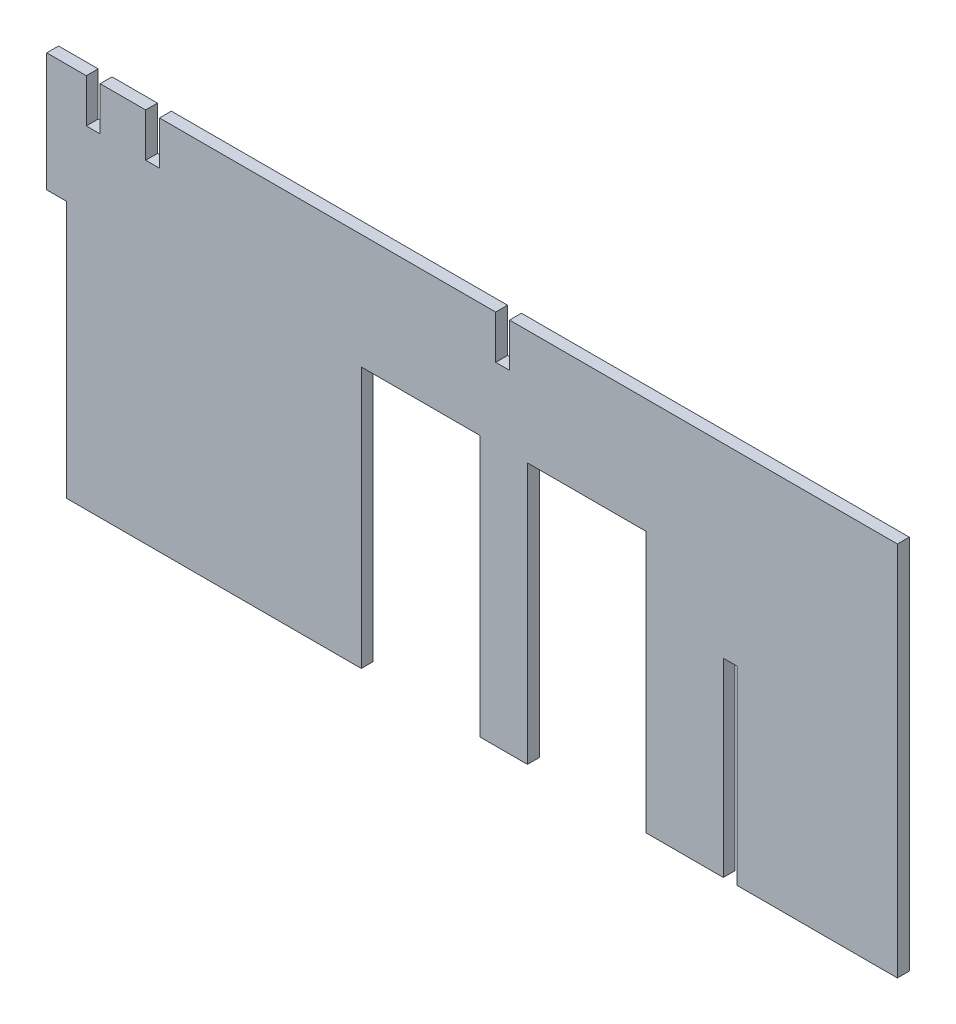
ISO-10303-21;
HEADER;
FILE_DESCRIPTION(('STEP AP214'),'2;1');
FILE_NAME('part.step','',(''),(''),'','','');
FILE_SCHEMA(('AUTOMOTIVE_DESIGN { 1 0 10303 214 1 1 1 1 }'));
ENDSEC;
DATA;
#1=APPLICATION_CONTEXT('core data for automotive mechanical design processes');
#2=APPLICATION_PROTOCOL_DEFINITION('international standard','automotive_design',2000,#1);
#3=PRODUCT_CONTEXT('',#1,'mechanical');
#4=PRODUCT('Part','Part','',(#3));
#5=PRODUCT_RELATED_PRODUCT_CATEGORY('part','',(#4));
#6=PRODUCT_DEFINITION_FORMATION('','',#4);
#7=PRODUCT_DEFINITION_CONTEXT('part definition',#1,'design');
#8=PRODUCT_DEFINITION('design','',#6,#7);
#9=PRODUCT_DEFINITION_SHAPE('','',#8);
#10=(LENGTH_UNIT() NAMED_UNIT(*) SI_UNIT(.MILLI.,.METRE.));
#11=(NAMED_UNIT(*) PLANE_ANGLE_UNIT() SI_UNIT($,.RADIAN.));
#12=(NAMED_UNIT(*) SI_UNIT($,.STERADIAN.) SOLID_ANGLE_UNIT());
#13=UNCERTAINTY_MEASURE_WITH_UNIT(LENGTH_MEASURE(1.E-05),#10,'distance_accuracy_value','');
#14=(GEOMETRIC_REPRESENTATION_CONTEXT(3) GLOBAL_UNCERTAINTY_ASSIGNED_CONTEXT((#13)) GLOBAL_UNIT_ASSIGNED_CONTEXT((#10,
#11,#12)) REPRESENTATION_CONTEXT('',''));
#15=CARTESIAN_POINT('',(0.,0.,0.));
#16=DIRECTION('',(0.,0.,1.));
#17=DIRECTION('',(1.,0.,0.));
#18=AXIS2_PLACEMENT_3D('',#15,#16,#17);
#19=CARTESIAN_POINT('',(0.,0.,3.));
#20=DIRECTION('',(0.,1.,0.));
#21=DIRECTION('',(0.,0.,1.));
#22=AXIS2_PLACEMENT_3D('',#19,#20,#21);
#23=PLANE('',#22);
#24=DIRECTION('',(1.,0.,0.));
#25=VECTOR('',#24,1.);
#26=CARTESIAN_POINT('',(0.,0.,0.));
#27=LINE('',#26,#25);
#28=CARTESIAN_POINT('',(151.5,0.,0.));
#29=VERTEX_POINT('',#28);
#30=CARTESIAN_POINT('',(171.,0.,0.));
#31=VERTEX_POINT('',#30);
#32=EDGE_CURVE('E244',#29,#31,#27,.T.);
#33=ORIENTED_EDGE('',*,*,#32,.T.);
#34=DIRECTION('',(0.,0.,1.));
#35=VECTOR('',#34,1.);
#36=CARTESIAN_POINT('',(171.,0.,0.));
#37=LINE('',#36,#35);
#38=CARTESIAN_POINT('',(171.,0.,3.));
#39=VERTEX_POINT('',#38);
#40=EDGE_CURVE('E228',#31,#39,#37,.T.);
#41=ORIENTED_EDGE('',*,*,#40,.T.);
#42=DIRECTION('',(1.,0.,0.));
#43=VECTOR('',#42,1.);
#44=CARTESIAN_POINT('',(0.,0.,3.));
#45=LINE('',#44,#43);
#46=CARTESIAN_POINT('',(151.5,0.,3.));
#47=VERTEX_POINT('',#46);
#48=EDGE_CURVE('E501',#47,#39,#45,.T.);
#49=ORIENTED_EDGE('',*,*,#48,.F.);
#50=DIRECTION('',(0.,0.,1.));
#51=VECTOR('',#50,1.);
#52=CARTESIAN_POINT('',(151.5,0.,0.));
#53=LINE('',#52,#51);
#54=EDGE_CURVE('E250',#29,#47,#53,.T.);
#55=ORIENTED_EDGE('',*,*,#54,.F.);
#56=EDGE_LOOP('',(#33,#41,#49,#55));
#57=FACE_BOUND('',#56,.T.);
#58=ADVANCED_FACE('F31',(#57),#23,.F.);
#59=CARTESIAN_POINT('',(0.,95.,3.));
#60=DIRECTION('',(0.,-1.,0.));
#61=DIRECTION('',(0.,0.,-1.));
#62=AXIS2_PLACEMENT_3D('',#59,#60,#61);
#63=PLANE('',#62);
#64=DIRECTION('',(-1.,0.,0.));
#65=VECTOR('',#64,1.);
#66=CARTESIAN_POINT('',(0.,95.,3.));
#67=LINE('',#66,#65);
#68=CARTESIAN_POINT('',(113.470074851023,95.,3.));
#69=VERTEX_POINT('',#68);
#70=CARTESIAN_POINT('',(28.5,95.,3.));
#71=VERTEX_POINT('',#70);
#72=EDGE_CURVE('E441',#69,#71,#67,.T.);
#73=ORIENTED_EDGE('',*,*,#72,.F.);
#74=DIRECTION('',(0.,0.,1.));
#75=VECTOR('',#74,1.);
#76=CARTESIAN_POINT('',(113.470074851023,95.,0.));
#77=LINE('',#76,#75);
#78=CARTESIAN_POINT('',(113.470074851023,95.,0.));
#79=VERTEX_POINT('',#78);
#80=EDGE_CURVE('E305',#79,#69,#77,.T.);
#81=ORIENTED_EDGE('',*,*,#80,.F.);
#82=DIRECTION('',(-1.,0.,0.));
#83=VECTOR('',#82,1.);
#84=CARTESIAN_POINT('',(0.,95.,0.));
#85=LINE('',#84,#83);
#86=CARTESIAN_POINT('',(28.5,95.,0.));
#87=VERTEX_POINT('',#86);
#88=EDGE_CURVE('E268',#79,#87,#85,.T.);
#89=ORIENTED_EDGE('',*,*,#88,.T.);
#90=DIRECTION('',(0.,0.,1.));
#91=VECTOR('',#90,1.);
#92=CARTESIAN_POINT('',(28.5,95.,0.));
#93=LINE('',#92,#91);
#94=EDGE_CURVE('E332',#87,#71,#93,.T.);
#95=ORIENTED_EDGE('',*,*,#94,.T.);
#96=EDGE_LOOP('',(#73,#81,#89,#95));
#97=FACE_BOUND('',#96,.T.);
#98=ADVANCED_FACE('F520',(#97),#63,.F.);
#99=CARTESIAN_POINT('',(25.,95.,3.));
#100=VERTEX_POINT('',#99);
#101=CARTESIAN_POINT('',(13.5,95.,3.));
#102=VERTEX_POINT('',#101);
#103=EDGE_CURVE('E444',#100,#102,#67,.T.);
#104=ORIENTED_EDGE('',*,*,#103,.F.);
#105=DIRECTION('',(0.,0.,1.));
#106=VECTOR('',#105,1.);
#107=CARTESIAN_POINT('',(25.,95.,0.));
#108=LINE('',#107,#106);
#109=CARTESIAN_POINT('',(25.,95.,0.));
#110=VERTEX_POINT('',#109);
#111=EDGE_CURVE('E329',#110,#100,#108,.T.);
#112=ORIENTED_EDGE('',*,*,#111,.F.);
#113=CARTESIAN_POINT('',(13.5,95.,0.));
#114=VERTEX_POINT('',#113);
#115=EDGE_CURVE('E462',#110,#114,#85,.T.);
#116=ORIENTED_EDGE('',*,*,#115,.T.);
#117=DIRECTION('',(0.,0.,1.));
#118=VECTOR('',#117,1.);
#119=CARTESIAN_POINT('',(13.5,95.,0.));
#120=LINE('',#119,#118);
#121=EDGE_CURVE('E359',#114,#102,#120,.T.);
#122=ORIENTED_EDGE('',*,*,#121,.T.);
#123=EDGE_LOOP('',(#104,#112,#116,#122));
#124=FACE_BOUND('',#123,.T.);
#125=ADVANCED_FACE('F460',(#124),#63,.F.);
#126=CARTESIAN_POINT('',(10.,95.,3.));
#127=VERTEX_POINT('',#126);
#128=CARTESIAN_POINT('',(0.,95.,3.));
#129=VERTEX_POINT('',#128);
#130=EDGE_CURVE('E440',#127,#129,#67,.T.);
#131=ORIENTED_EDGE('',*,*,#130,.F.);
#132=DIRECTION('',(0.,0.,1.));
#133=VECTOR('',#132,1.);
#134=CARTESIAN_POINT('',(10.,95.,0.));
#135=LINE('',#134,#133);
#136=CARTESIAN_POINT('',(10.,95.,0.));
#137=VERTEX_POINT('',#136);
#138=EDGE_CURVE('E356',#137,#127,#135,.T.);
#139=ORIENTED_EDGE('',*,*,#138,.F.);
#140=CARTESIAN_POINT('',(0.,95.,0.));
#141=VERTEX_POINT('',#140);
#142=EDGE_CURVE('E263',#137,#141,#85,.T.);
#143=ORIENTED_EDGE('',*,*,#142,.T.);
#144=DIRECTION('',(0.,0.,-1.));
#145=VECTOR('',#144,1.);
#146=CARTESIAN_POINT('',(0.,95.,3.));
#147=LINE('',#146,#145);
#148=EDGE_CURVE('E269',#129,#141,#147,.T.);
#149=ORIENTED_EDGE('',*,*,#148,.F.);
#150=EDGE_LOOP('',(#131,#139,#143,#149));
#151=FACE_BOUND('',#150,.T.);
#152=ADVANCED_FACE('F466',(#151),#63,.F.);
#153=CARTESIAN_POINT('',(109.5,0.,0.));
#154=VERTEX_POINT('',#153);
#155=CARTESIAN_POINT('',(121.5,0.,0.));
#156=VERTEX_POINT('',#155);
#157=EDGE_CURVE('E251',#154,#156,#27,.T.);
#158=ORIENTED_EDGE('',*,*,#157,.T.);
#159=DIRECTION('',(0.,0.,1.));
#160=VECTOR('',#159,1.);
#161=CARTESIAN_POINT('',(121.5,0.,0.));
#162=LINE('',#161,#160);
#163=CARTESIAN_POINT('',(121.5,0.,3.));
#164=VERTEX_POINT('',#163);
#165=EDGE_CURVE('E374',#156,#164,#162,.T.);
#166=ORIENTED_EDGE('',*,*,#165,.T.);
#167=CARTESIAN_POINT('',(109.5,0.,3.));
#168=VERTEX_POINT('',#167);
#169=EDGE_CURVE('E439',#168,#164,#45,.T.);
#170=ORIENTED_EDGE('',*,*,#169,.F.);
#171=DIRECTION('',(0.,0.,1.));
#172=VECTOR('',#171,1.);
#173=CARTESIAN_POINT('',(109.5,0.,0.));
#174=LINE('',#173,#172);
#175=EDGE_CURVE('E411',#154,#168,#174,.T.);
#176=ORIENTED_EDGE('',*,*,#175,.F.);
#177=EDGE_LOOP('',(#158,#166,#170,#176));
#178=FACE_BOUND('',#177,.T.);
#179=ADVANCED_FACE('F500',(#178),#23,.F.);
#180=CARTESIAN_POINT('',(5.00000000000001,0.,0.));
#181=VERTEX_POINT('',#180);
#182=CARTESIAN_POINT('',(79.5,0.,0.));
#183=VERTEX_POINT('',#182);
#184=EDGE_CURVE('E255',#181,#183,#27,.T.);
#185=ORIENTED_EDGE('',*,*,#184,.T.);
#186=DIRECTION('',(0.,0.,1.));
#187=VECTOR('',#186,1.);
#188=CARTESIAN_POINT('',(79.5,0.,0.));
#189=LINE('',#188,#187);
#190=CARTESIAN_POINT('',(79.5,0.,3.));
#191=VERTEX_POINT('',#190);
#192=EDGE_CURVE('E399',#183,#191,#189,.T.);
#193=ORIENTED_EDGE('',*,*,#192,.T.);
#194=CARTESIAN_POINT('',(5.00000000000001,0.,3.));
#195=VERTEX_POINT('',#194);
#196=EDGE_CURVE('E435',#195,#191,#45,.T.);
#197=ORIENTED_EDGE('',*,*,#196,.F.);
#198=DIRECTION('',(0.,0.,1.));
#199=VECTOR('',#198,1.);
#200=CARTESIAN_POINT('',(5.00000000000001,0.,0.));
#201=LINE('',#200,#199);
#202=EDGE_CURVE('E422',#181,#195,#201,.T.);
#203=ORIENTED_EDGE('',*,*,#202,.F.);
#204=EDGE_LOOP('',(#185,#193,#197,#203));
#205=FACE_BOUND('',#204,.T.);
#206=ADVANCED_FACE('F483',(#205),#23,.F.);
#207=CARTESIAN_POINT('',(0.,0.,3.));
#208=DIRECTION('',(1.,0.,0.));
#209=DIRECTION('',(0.,0.,-1.));
#210=AXIS2_PLACEMENT_3D('',#207,#208,#209);
#211=PLANE('',#210);
#212=DIRECTION('',(0.,-1.,0.));
#213=VECTOR('',#212,1.);
#214=CARTESIAN_POINT('',(0.,0.,0.));
#215=LINE('',#214,#213);
#216=CARTESIAN_POINT('',(0.,65.,0.));
#217=VERTEX_POINT('',#216);
#218=EDGE_CURVE('E256',#141,#217,#215,.T.);
#219=ORIENTED_EDGE('',*,*,#218,.T.);
#220=DIRECTION('',(0.,0.,1.));
#221=VECTOR('',#220,1.);
#222=CARTESIAN_POINT('',(0.,65.,0.));
#223=LINE('',#222,#221);
#224=CARTESIAN_POINT('',(0.,65.,3.));
#225=VERTEX_POINT('',#224);
#226=EDGE_CURVE('E426',#217,#225,#223,.T.);
#227=ORIENTED_EDGE('',*,*,#226,.T.);
#228=DIRECTION('',(0.,-1.,0.));
#229=VECTOR('',#228,1.);
#230=CARTESIAN_POINT('',(0.,0.,3.));
#231=LINE('',#230,#229);
#232=EDGE_CURVE('E267',#129,#225,#231,.T.);
#233=ORIENTED_EDGE('',*,*,#232,.F.);
#234=ORIENTED_EDGE('',*,*,#148,.T.);
#235=EDGE_LOOP('',(#219,#227,#233,#234));
#236=FACE_BOUND('',#235,.T.);
#237=ADVANCED_FACE('F33',(#236),#211,.F.);
#238=CARTESIAN_POINT('',(174.5,0.,3.));
#239=VERTEX_POINT('',#238);
#240=CARTESIAN_POINT('',(215.,0.,3.));
#241=VERTEX_POINT('',#240);
#242=EDGE_CURVE('E434',#239,#241,#45,.T.);
#243=ORIENTED_EDGE('',*,*,#242,.F.);
#244=DIRECTION('',(0.,0.,1.));
#245=VECTOR('',#244,1.);
#246=CARTESIAN_POINT('',(174.5,0.,0.));
#247=LINE('',#246,#245);
#248=CARTESIAN_POINT('',(174.5,0.,0.));
#249=VERTEX_POINT('',#248);
#250=EDGE_CURVE('E238',#249,#239,#247,.T.);
#251=ORIENTED_EDGE('',*,*,#250,.F.);
#252=CARTESIAN_POINT('',(215.,0.,0.));
#253=VERTEX_POINT('',#252);
#254=EDGE_CURVE('E252',#249,#253,#27,.T.);
#255=ORIENTED_EDGE('',*,*,#254,.T.);
#256=DIRECTION('',(0.,0.,-1.));
#257=VECTOR('',#256,1.);
#258=CARTESIAN_POINT('',(215.,0.,3.));
#259=LINE('',#258,#257);
#260=EDGE_CURVE('E11',#241,#253,#259,.T.);
#261=ORIENTED_EDGE('',*,*,#260,.F.);
#262=EDGE_LOOP('',(#243,#251,#255,#261));
#263=FACE_BOUND('',#262,.T.);
#264=ADVANCED_FACE('F511',(#263),#23,.F.);
#265=CARTESIAN_POINT('',(215.,0.,3.));
#266=DIRECTION('',(-1.,0.,0.));
#267=DIRECTION('',(0.,0.,1.));
#268=AXIS2_PLACEMENT_3D('',#265,#266,#267);
#269=PLANE('',#268);
#270=DIRECTION('',(0.,1.,0.));
#271=VECTOR('',#270,1.);
#272=CARTESIAN_POINT('',(215.,0.,0.));
#273=LINE('',#272,#271);
#274=CARTESIAN_POINT('',(215.,95.,0.));
#275=VERTEX_POINT('',#274);
#276=EDGE_CURVE('E260',#253,#275,#273,.T.);
#277=ORIENTED_EDGE('',*,*,#276,.T.);
#278=DIRECTION('',(0.,0.,-1.));
#279=VECTOR('',#278,1.);
#280=CARTESIAN_POINT('',(215.,95.,3.));
#281=LINE('',#280,#279);
#282=CARTESIAN_POINT('',(215.,95.,3.));
#283=VERTEX_POINT('',#282);
#284=EDGE_CURVE('E39',#283,#275,#281,.T.);
#285=ORIENTED_EDGE('',*,*,#284,.F.);
#286=DIRECTION('',(0.,1.,0.));
#287=VECTOR('',#286,1.);
#288=CARTESIAN_POINT('',(215.,0.,3.));
#289=LINE('',#288,#287);
#290=EDGE_CURVE('E438',#241,#283,#289,.T.);
#291=ORIENTED_EDGE('',*,*,#290,.F.);
#292=ORIENTED_EDGE('',*,*,#260,.T.);
#293=EDGE_LOOP('',(#277,#285,#291,#292));
#294=FACE_BOUND('',#293,.T.);
#295=ADVANCED_FACE('F512',(#294),#269,.F.);
#296=CARTESIAN_POINT('',(116.970074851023,95.,0.));
#297=VERTEX_POINT('',#296);
#298=EDGE_CURVE('E264',#275,#297,#85,.T.);
#299=ORIENTED_EDGE('',*,*,#298,.T.);
#300=DIRECTION('',(0.,0.,1.));
#301=VECTOR('',#300,1.);
#302=CARTESIAN_POINT('',(116.970074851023,95.,0.));
#303=LINE('',#302,#301);
#304=CARTESIAN_POINT('',(116.970074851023,95.,3.));
#305=VERTEX_POINT('',#304);
#306=EDGE_CURVE('E308',#297,#305,#303,.T.);
#307=ORIENTED_EDGE('',*,*,#306,.T.);
#308=EDGE_CURVE('E271',#283,#305,#67,.T.);
#309=ORIENTED_EDGE('',*,*,#308,.F.);
#310=ORIENTED_EDGE('',*,*,#284,.T.);
#311=EDGE_LOOP('',(#299,#307,#309,#310));
#312=FACE_BOUND('',#311,.T.);
#313=ADVANCED_FACE('F277',(#312),#63,.F.);
#314=CARTESIAN_POINT('',(0.,95.,3.));
#315=DIRECTION('',(0.,0.,-1.));
#316=DIRECTION('',(-1.,0.,0.));
#317=AXIS2_PLACEMENT_3D('',#314,#315,#316);
#318=PLANE('',#317);
#319=ORIENTED_EDGE('',*,*,#48,.T.);
#320=DIRECTION('',(0.,-1.,0.));
#321=VECTOR('',#320,1.);
#322=CARTESIAN_POINT('',(171.,0.,3.));
#323=LINE('',#322,#321);
#324=CARTESIAN_POINT('',(171.,48.,3.));
#325=VERTEX_POINT('',#324);
#326=EDGE_CURVE('E233',#325,#39,#323,.T.);
#327=ORIENTED_EDGE('',*,*,#326,.F.);
#328=DIRECTION('',(-1.,0.,0.));
#329=VECTOR('',#328,1.);
#330=CARTESIAN_POINT('',(171.,48.,3.));
#331=LINE('',#330,#329);
#332=CARTESIAN_POINT('',(174.5,48.,3.));
#333=VERTEX_POINT('',#332);
#334=EDGE_CURVE('E247',#333,#325,#331,.T.);
#335=ORIENTED_EDGE('',*,*,#334,.F.);
#336=DIRECTION('',(0.,1.,0.));
#337=VECTOR('',#336,1.);
#338=CARTESIAN_POINT('',(174.5,0.,3.));
#339=LINE('',#338,#337);
#340=EDGE_CURVE('E508',#239,#333,#339,.T.);
#341=ORIENTED_EDGE('',*,*,#340,.F.);
#342=ORIENTED_EDGE('',*,*,#242,.T.);
#343=ORIENTED_EDGE('',*,*,#290,.T.);
#344=ORIENTED_EDGE('',*,*,#308,.T.);
#345=DIRECTION('',(0.,1.,0.));
#346=VECTOR('',#345,1.);
#347=CARTESIAN_POINT('',(116.970074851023,95.,3.));
#348=LINE('',#347,#346);
#349=CARTESIAN_POINT('',(116.970074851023,84.,3.));
#350=VERTEX_POINT('',#349);
#351=EDGE_CURVE('E303',#350,#305,#348,.T.);
#352=ORIENTED_EDGE('',*,*,#351,.F.);
#353=DIRECTION('',(1.,0.,0.));
#354=VECTOR('',#353,1.);
#355=CARTESIAN_POINT('',(113.470074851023,84.,3.));
#356=LINE('',#355,#354);
#357=CARTESIAN_POINT('',(113.470074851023,84.,3.));
#358=VERTEX_POINT('',#357);
#359=EDGE_CURVE('E299',#358,#350,#356,.T.);
#360=ORIENTED_EDGE('',*,*,#359,.F.);
#361=DIRECTION('',(0.,-1.,0.));
#362=VECTOR('',#361,1.);
#363=CARTESIAN_POINT('',(113.470074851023,95.,3.));
#364=LINE('',#363,#362);
#365=EDGE_CURVE('E296',#69,#358,#364,.T.);
#366=ORIENTED_EDGE('',*,*,#365,.F.);
#367=ORIENTED_EDGE('',*,*,#72,.T.);
#368=DIRECTION('',(0.,1.,0.));
#369=VECTOR('',#368,1.);
#370=CARTESIAN_POINT('',(28.5,95.,3.));
#371=LINE('',#370,#369);
#372=CARTESIAN_POINT('',(28.5,84.,3.));
#373=VERTEX_POINT('',#372);
#374=EDGE_CURVE('E315',#373,#71,#371,.T.);
#375=ORIENTED_EDGE('',*,*,#374,.F.);
#376=DIRECTION('',(1.,0.,0.));
#377=VECTOR('',#376,1.);
#378=CARTESIAN_POINT('',(25.,84.,3.));
#379=LINE('',#378,#377);
#380=CARTESIAN_POINT('',(25.,84.,3.));
#381=VERTEX_POINT('',#380);
#382=EDGE_CURVE('E324',#381,#373,#379,.T.);
#383=ORIENTED_EDGE('',*,*,#382,.F.);
#384=DIRECTION('',(0.,-1.,0.));
#385=VECTOR('',#384,1.);
#386=CARTESIAN_POINT('',(25.,95.,3.));
#387=LINE('',#386,#385);
#388=EDGE_CURVE('E307',#100,#381,#387,.T.);
#389=ORIENTED_EDGE('',*,*,#388,.F.);
#390=ORIENTED_EDGE('',*,*,#103,.T.);
#391=DIRECTION('',(0.,1.,0.));
#392=VECTOR('',#391,1.);
#393=CARTESIAN_POINT('',(13.5,95.,3.));
#394=LINE('',#393,#392);
#395=CARTESIAN_POINT('',(13.5,84.,3.));
#396=VERTEX_POINT('',#395);
#397=EDGE_CURVE('E342',#396,#102,#394,.T.);
#398=ORIENTED_EDGE('',*,*,#397,.F.);
#399=DIRECTION('',(1.,0.,0.));
#400=VECTOR('',#399,1.);
#401=CARTESIAN_POINT('',(10.,84.,3.));
#402=LINE('',#401,#400);
#403=CARTESIAN_POINT('',(10.,84.,3.));
#404=VERTEX_POINT('',#403);
#405=EDGE_CURVE('E351',#404,#396,#402,.T.);
#406=ORIENTED_EDGE('',*,*,#405,.F.);
#407=DIRECTION('',(0.,-1.,0.));
#408=VECTOR('',#407,1.);
#409=CARTESIAN_POINT('',(10.,95.,3.));
#410=LINE('',#409,#408);
#411=EDGE_CURVE('E331',#127,#404,#410,.T.);
#412=ORIENTED_EDGE('',*,*,#411,.F.);
#413=ORIENTED_EDGE('',*,*,#130,.T.);
#414=ORIENTED_EDGE('',*,*,#232,.T.);
#415=DIRECTION('',(-1.,0.,0.));
#416=VECTOR('',#415,1.);
#417=CARTESIAN_POINT('',(0.,65.,3.));
#418=LINE('',#417,#416);
#419=CARTESIAN_POINT('',(5.,65.,3.));
#420=VERTEX_POINT('',#419);
#421=EDGE_CURVE('E419',#420,#225,#418,.T.);
#422=ORIENTED_EDGE('',*,*,#421,.F.);
#423=DIRECTION('',(0.,1.,0.));
#424=VECTOR('',#423,1.);
#425=CARTESIAN_POINT('',(5.,65.,3.));
#426=LINE('',#425,#424);
#427=EDGE_CURVE('E408',#195,#420,#426,.T.);
#428=ORIENTED_EDGE('',*,*,#427,.F.);
#429=ORIENTED_EDGE('',*,*,#196,.T.);
#430=DIRECTION('',(0.,-1.,0.));
#431=VECTOR('',#430,1.);
#432=CARTESIAN_POINT('',(79.5,0.,3.));
#433=LINE('',#432,#431);
#434=CARTESIAN_POINT('',(79.5,66.,3.));
#435=VERTEX_POINT('',#434);
#436=EDGE_CURVE('E383',#435,#191,#433,.T.);
#437=ORIENTED_EDGE('',*,*,#436,.F.);
#438=DIRECTION('',(-1.,0.,0.));
#439=VECTOR('',#438,1.);
#440=CARTESIAN_POINT('',(79.5,66.,3.));
#441=LINE('',#440,#439);
#442=CARTESIAN_POINT('',(109.5,66.,3.));
#443=VERTEX_POINT('',#442);
#444=EDGE_CURVE('E393',#443,#435,#441,.T.);
#445=ORIENTED_EDGE('',*,*,#444,.F.);
#446=DIRECTION('',(0.,1.,0.));
#447=VECTOR('',#446,1.);
#448=CARTESIAN_POINT('',(109.5,0.,3.));
#449=LINE('',#448,#447);
#450=EDGE_CURVE('E401',#168,#443,#449,.T.);
#451=ORIENTED_EDGE('',*,*,#450,.F.);
#452=ORIENTED_EDGE('',*,*,#169,.T.);
#453=DIRECTION('',(0.,-1.,0.));
#454=VECTOR('',#453,1.);
#455=CARTESIAN_POINT('',(121.5,0.,3.));
#456=LINE('',#455,#454);
#457=CARTESIAN_POINT('',(121.5,66.,3.));
#458=VERTEX_POINT('',#457);
#459=EDGE_CURVE('E358',#458,#164,#456,.T.);
#460=ORIENTED_EDGE('',*,*,#459,.F.);
#461=DIRECTION('',(-1.,0.,0.));
#462=VECTOR('',#461,1.);
#463=CARTESIAN_POINT('',(121.5,66.,3.));
#464=LINE('',#463,#462);
#465=CARTESIAN_POINT('',(151.5,66.,3.));
#466=VERTEX_POINT('',#465);
#467=EDGE_CURVE('E369',#466,#458,#464,.T.);
#468=ORIENTED_EDGE('',*,*,#467,.F.);
#469=DIRECTION('',(0.,1.,0.));
#470=VECTOR('',#469,1.);
#471=CARTESIAN_POINT('',(151.5,0.,3.));
#472=LINE('',#471,#470);
#473=EDGE_CURVE('E376',#47,#466,#472,.T.);
#474=ORIENTED_EDGE('',*,*,#473,.F.);
#475=EDGE_LOOP('',(#319,#327,#335,#341,#342,#343,#344,#352,#360,#366,#367,#375,#383,#389,#390,
#398,#406,#412,#413,#414,#422,#428,#429,#437,#445,#451,#452,#460,#468,#474));
#476=FACE_BOUND('',#475,.T.);
#477=ADVANCED_FACE('F451',(#476),#318,.F.);
#478=CARTESIAN_POINT('',(0.,95.,0.));
#479=DIRECTION('',(0.,0.,-1.));
#480=DIRECTION('',(-1.,0.,0.));
#481=AXIS2_PLACEMENT_3D('',#478,#479,#480);
#482=PLANE('',#481);
#483=DIRECTION('',(0.,-1.,0.));
#484=VECTOR('',#483,1.);
#485=CARTESIAN_POINT('',(171.,0.,0.));
#486=LINE('',#485,#484);
#487=CARTESIAN_POINT('',(171.,48.,0.));
#488=VERTEX_POINT('',#487);
#489=EDGE_CURVE('E231',#488,#31,#486,.T.);
#490=ORIENTED_EDGE('',*,*,#489,.T.);
#491=ORIENTED_EDGE('',*,*,#32,.F.);
#492=DIRECTION('',(0.,1.,0.));
#493=VECTOR('',#492,1.);
#494=CARTESIAN_POINT('',(151.5,0.,0.));
#495=LINE('',#494,#493);
#496=CARTESIAN_POINT('',(151.5,66.,0.));
#497=VERTEX_POINT('',#496);
#498=EDGE_CURVE('E368',#29,#497,#495,.T.);
#499=ORIENTED_EDGE('',*,*,#498,.T.);
#500=DIRECTION('',(-1.,0.,0.));
#501=VECTOR('',#500,1.);
#502=CARTESIAN_POINT('',(121.5,66.,0.));
#503=LINE('',#502,#501);
#504=CARTESIAN_POINT('',(121.5,66.,0.));
#505=VERTEX_POINT('',#504);
#506=EDGE_CURVE('E371',#497,#505,#503,.T.);
#507=ORIENTED_EDGE('',*,*,#506,.T.);
#508=DIRECTION('',(0.,-1.,0.));
#509=VECTOR('',#508,1.);
#510=CARTESIAN_POINT('',(121.5,0.,0.));
#511=LINE('',#510,#509);
#512=EDGE_CURVE('E365',#505,#156,#511,.T.);
#513=ORIENTED_EDGE('',*,*,#512,.T.);
#514=ORIENTED_EDGE('',*,*,#157,.F.);
#515=DIRECTION('',(0.,1.,0.));
#516=VECTOR('',#515,1.);
#517=CARTESIAN_POINT('',(109.5,0.,0.));
#518=LINE('',#517,#516);
#519=CARTESIAN_POINT('',(109.5,66.,0.));
#520=VERTEX_POINT('',#519);
#521=EDGE_CURVE('E392',#154,#520,#518,.T.);
#522=ORIENTED_EDGE('',*,*,#521,.T.);
#523=DIRECTION('',(-1.,0.,0.));
#524=VECTOR('',#523,1.);
#525=CARTESIAN_POINT('',(79.5,66.,0.));
#526=LINE('',#525,#524);
#527=CARTESIAN_POINT('',(79.5,66.,0.));
#528=VERTEX_POINT('',#527);
#529=EDGE_CURVE('E396',#520,#528,#526,.T.);
#530=ORIENTED_EDGE('',*,*,#529,.T.);
#531=DIRECTION('',(0.,-1.,0.));
#532=VECTOR('',#531,1.);
#533=CARTESIAN_POINT('',(79.5,0.,0.));
#534=LINE('',#533,#532);
#535=EDGE_CURVE('E389',#528,#183,#534,.T.);
#536=ORIENTED_EDGE('',*,*,#535,.T.);
#537=ORIENTED_EDGE('',*,*,#184,.F.);
#538=DIRECTION('',(0.,1.,0.));
#539=VECTOR('',#538,1.);
#540=CARTESIAN_POINT('',(5.,65.,0.));
#541=LINE('',#540,#539);
#542=CARTESIAN_POINT('',(5.,65.,0.));
#543=VERTEX_POINT('',#542);
#544=EDGE_CURVE('E415',#181,#543,#541,.T.);
#545=ORIENTED_EDGE('',*,*,#544,.T.);
#546=DIRECTION('',(-1.,0.,0.));
#547=VECTOR('',#546,1.);
#548=CARTESIAN_POINT('',(0.,65.,0.));
#549=LINE('',#548,#547);
#550=EDGE_CURVE('E418',#543,#217,#549,.T.);
#551=ORIENTED_EDGE('',*,*,#550,.T.);
#552=ORIENTED_EDGE('',*,*,#218,.F.);
#553=ORIENTED_EDGE('',*,*,#142,.F.);
#554=DIRECTION('',(0.,-1.,0.));
#555=VECTOR('',#554,1.);
#556=CARTESIAN_POINT('',(10.,95.,0.));
#557=LINE('',#556,#555);
#558=CARTESIAN_POINT('',(10.,84.,0.));
#559=VERTEX_POINT('',#558);
#560=EDGE_CURVE('E338',#137,#559,#557,.T.);
#561=ORIENTED_EDGE('',*,*,#560,.T.);
#562=DIRECTION('',(1.,0.,0.));
#563=VECTOR('',#562,1.);
#564=CARTESIAN_POINT('',(10.,84.,0.));
#565=LINE('',#564,#563);
#566=CARTESIAN_POINT('',(13.5,84.,0.));
#567=VERTEX_POINT('',#566);
#568=EDGE_CURVE('E341',#559,#567,#565,.T.);
#569=ORIENTED_EDGE('',*,*,#568,.T.);
#570=DIRECTION('',(0.,1.,0.));
#571=VECTOR('',#570,1.);
#572=CARTESIAN_POINT('',(13.5,95.,0.));
#573=LINE('',#572,#571);
#574=EDGE_CURVE('E345',#567,#114,#573,.T.);
#575=ORIENTED_EDGE('',*,*,#574,.T.);
#576=ORIENTED_EDGE('',*,*,#115,.F.);
#577=DIRECTION('',(0.,-1.,0.));
#578=VECTOR('',#577,1.);
#579=CARTESIAN_POINT('',(25.,95.,0.));
#580=LINE('',#579,#578);
#581=CARTESIAN_POINT('',(25.,84.,0.));
#582=VERTEX_POINT('',#581);
#583=EDGE_CURVE('E311',#110,#582,#580,.T.);
#584=ORIENTED_EDGE('',*,*,#583,.T.);
#585=DIRECTION('',(1.,0.,0.));
#586=VECTOR('',#585,1.);
#587=CARTESIAN_POINT('',(25.,84.,0.));
#588=LINE('',#587,#586);
#589=CARTESIAN_POINT('',(28.5,84.,0.));
#590=VERTEX_POINT('',#589);
#591=EDGE_CURVE('E314',#582,#590,#588,.T.);
#592=ORIENTED_EDGE('',*,*,#591,.T.);
#593=DIRECTION('',(0.,1.,0.));
#594=VECTOR('',#593,1.);
#595=CARTESIAN_POINT('',(28.5,95.,0.));
#596=LINE('',#595,#594);
#597=EDGE_CURVE('E318',#590,#87,#596,.T.);
#598=ORIENTED_EDGE('',*,*,#597,.T.);
#599=ORIENTED_EDGE('',*,*,#88,.F.);
#600=DIRECTION('',(0.,-1.,0.));
#601=VECTOR('',#600,1.);
#602=CARTESIAN_POINT('',(113.470074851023,95.,0.));
#603=LINE('',#602,#601);
#604=CARTESIAN_POINT('',(113.470074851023,84.,0.));
#605=VERTEX_POINT('',#604);
#606=EDGE_CURVE('E292',#79,#605,#603,.T.);
#607=ORIENTED_EDGE('',*,*,#606,.T.);
#608=DIRECTION('',(1.,0.,0.));
#609=VECTOR('',#608,1.);
#610=CARTESIAN_POINT('',(113.470074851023,84.,0.));
#611=LINE('',#610,#609);
#612=CARTESIAN_POINT('',(116.970074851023,84.,0.));
#613=VERTEX_POINT('',#612);
#614=EDGE_CURVE('E287',#605,#613,#611,.T.);
#615=ORIENTED_EDGE('',*,*,#614,.T.);
#616=DIRECTION('',(0.,1.,0.));
#617=VECTOR('',#616,1.);
#618=CARTESIAN_POINT('',(116.970074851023,95.,0.));
#619=LINE('',#618,#617);
#620=EDGE_CURVE('E54',#613,#297,#619,.T.);
#621=ORIENTED_EDGE('',*,*,#620,.T.);
#622=ORIENTED_EDGE('',*,*,#298,.F.);
#623=ORIENTED_EDGE('',*,*,#276,.F.);
#624=ORIENTED_EDGE('',*,*,#254,.F.);
#625=DIRECTION('',(0.,1.,0.));
#626=VECTOR('',#625,1.);
#627=CARTESIAN_POINT('',(174.5,0.,0.));
#628=LINE('',#627,#626);
#629=CARTESIAN_POINT('',(174.5,48.,0.));
#630=VERTEX_POINT('',#629);
#631=EDGE_CURVE('E246',#249,#630,#628,.T.);
#632=ORIENTED_EDGE('',*,*,#631,.T.);
#633=DIRECTION('',(-1.,0.,0.));
#634=VECTOR('',#633,1.);
#635=CARTESIAN_POINT('',(171.,48.,0.));
#636=LINE('',#635,#634);
#637=EDGE_CURVE('E46',#630,#488,#636,.T.);
#638=ORIENTED_EDGE('',*,*,#637,.T.);
#639=EDGE_LOOP('',(#490,#491,#499,#507,#513,#514,#522,#530,#536,#537,#545,#551,#552,#553,#561,
#569,#575,#576,#584,#592,#598,#599,#607,#615,#621,#622,#623,#624,#632,#638));
#640=FACE_BOUND('',#639,.T.);
#641=ADVANCED_FACE('F242',(#640),#482,.T.);
#642=CARTESIAN_POINT('',(0.,65.,0.));
#643=DIRECTION('',(0.,1.,0.));
#644=DIRECTION('',(0.,0.,1.));
#645=AXIS2_PLACEMENT_3D('',#642,#643,#644);
#646=PLANE('',#645);
#647=ORIENTED_EDGE('',*,*,#421,.T.);
#648=ORIENTED_EDGE('',*,*,#226,.F.);
#649=ORIENTED_EDGE('',*,*,#550,.F.);
#650=DIRECTION('',(0.,0.,1.));
#651=VECTOR('',#650,1.);
#652=CARTESIAN_POINT('',(5.,65.,0.));
#653=LINE('',#652,#651);
#654=EDGE_CURVE('E429',#543,#420,#653,.T.);
#655=ORIENTED_EDGE('',*,*,#654,.T.);
#656=EDGE_LOOP('',(#647,#648,#649,#655));
#657=FACE_BOUND('',#656,.T.);
#658=ADVANCED_FACE('F474',(#657),#646,.F.);
#659=CARTESIAN_POINT('',(5.,65.,0.));
#660=DIRECTION('',(1.,0.,0.));
#661=DIRECTION('',(0.,1.,0.));
#662=AXIS2_PLACEMENT_3D('',#659,#660,#661);
#663=PLANE('',#662);
#664=ORIENTED_EDGE('',*,*,#427,.T.);
#665=ORIENTED_EDGE('',*,*,#654,.F.);
#666=ORIENTED_EDGE('',*,*,#544,.F.);
#667=ORIENTED_EDGE('',*,*,#202,.T.);
#668=EDGE_LOOP('',(#664,#665,#666,#667));
#669=FACE_BOUND('',#668,.T.);
#670=ADVANCED_FACE('F476',(#669),#663,.F.);
#671=CARTESIAN_POINT('',(79.5,0.,0.));
#672=DIRECTION('',(-1.,0.,0.));
#673=DIRECTION('',(0.,0.,1.));
#674=AXIS2_PLACEMENT_3D('',#671,#672,#673);
#675=PLANE('',#674);
#676=ORIENTED_EDGE('',*,*,#436,.T.);
#677=ORIENTED_EDGE('',*,*,#192,.F.);
#678=ORIENTED_EDGE('',*,*,#535,.F.);
#679=DIRECTION('',(0.,0.,1.));
#680=VECTOR('',#679,1.);
#681=CARTESIAN_POINT('',(79.5,66.,0.));
#682=LINE('',#681,#680);
#683=EDGE_CURVE('E406',#528,#435,#682,.T.);
#684=ORIENTED_EDGE('',*,*,#683,.T.);
#685=EDGE_LOOP('',(#676,#677,#678,#684));
#686=FACE_BOUND('',#685,.T.);
#687=ADVANCED_FACE('F486',(#686),#675,.F.);
#688=CARTESIAN_POINT('',(79.5,66.,0.));
#689=DIRECTION('',(0.,1.,0.));
#690=DIRECTION('',(0.,0.,1.));
#691=AXIS2_PLACEMENT_3D('',#688,#689,#690);
#692=PLANE('',#691);
#693=ORIENTED_EDGE('',*,*,#444,.T.);
#694=ORIENTED_EDGE('',*,*,#683,.F.);
#695=ORIENTED_EDGE('',*,*,#529,.F.);
#696=DIRECTION('',(0.,0.,1.));
#697=VECTOR('',#696,1.);
#698=CARTESIAN_POINT('',(109.5,66.,0.));
#699=LINE('',#698,#697);
#700=EDGE_CURVE('E409',#520,#443,#699,.T.);
#701=ORIENTED_EDGE('',*,*,#700,.T.);
#702=EDGE_LOOP('',(#693,#694,#695,#701));
#703=FACE_BOUND('',#702,.T.);
#704=ADVANCED_FACE('F490',(#703),#692,.F.);
#705=CARTESIAN_POINT('',(109.5,0.,0.));
#706=DIRECTION('',(1.,0.,0.));
#707=DIRECTION('',(0.,0.,-1.));
#708=AXIS2_PLACEMENT_3D('',#705,#706,#707);
#709=PLANE('',#708);
#710=ORIENTED_EDGE('',*,*,#450,.T.);
#711=ORIENTED_EDGE('',*,*,#700,.F.);
#712=ORIENTED_EDGE('',*,*,#521,.F.);
#713=ORIENTED_EDGE('',*,*,#175,.T.);
#714=EDGE_LOOP('',(#710,#711,#712,#713));
#715=FACE_BOUND('',#714,.T.);
#716=ADVANCED_FACE('F492',(#715),#709,.F.);
#717=CARTESIAN_POINT('',(121.5,0.,0.));
#718=DIRECTION('',(-1.,0.,0.));
#719=DIRECTION('',(0.,0.,1.));
#720=AXIS2_PLACEMENT_3D('',#717,#718,#719);
#721=PLANE('',#720);
#722=ORIENTED_EDGE('',*,*,#459,.T.);
#723=ORIENTED_EDGE('',*,*,#165,.F.);
#724=ORIENTED_EDGE('',*,*,#512,.F.);
#725=DIRECTION('',(0.,0.,1.));
#726=VECTOR('',#725,1.);
#727=CARTESIAN_POINT('',(121.5,66.,0.));
#728=LINE('',#727,#726);
#729=EDGE_CURVE('E381',#505,#458,#728,.T.);
#730=ORIENTED_EDGE('',*,*,#729,.T.);
#731=EDGE_LOOP('',(#722,#723,#724,#730));
#732=FACE_BOUND('',#731,.T.);
#733=ADVANCED_FACE('F547',(#732),#721,.F.);
#734=CARTESIAN_POINT('',(121.5,66.,0.));
#735=DIRECTION('',(0.,1.,0.));
#736=DIRECTION('',(0.,0.,1.));
#737=AXIS2_PLACEMENT_3D('',#734,#735,#736);
#738=PLANE('',#737);
#739=ORIENTED_EDGE('',*,*,#467,.T.);
#740=ORIENTED_EDGE('',*,*,#729,.F.);
#741=ORIENTED_EDGE('',*,*,#506,.F.);
#742=DIRECTION('',(0.,0.,1.));
#743=VECTOR('',#742,1.);
#744=CARTESIAN_POINT('',(151.5,66.,0.));
#745=LINE('',#744,#743);
#746=EDGE_CURVE('E384',#497,#466,#745,.T.);
#747=ORIENTED_EDGE('',*,*,#746,.T.);
#748=EDGE_LOOP('',(#739,#740,#741,#747));
#749=FACE_BOUND('',#748,.T.);
#750=ADVANCED_FACE('F552',(#749),#738,.F.);
#751=CARTESIAN_POINT('',(151.5,0.,0.));
#752=DIRECTION('',(1.,0.,0.));
#753=DIRECTION('',(0.,0.,-1.));
#754=AXIS2_PLACEMENT_3D('',#751,#752,#753);
#755=PLANE('',#754);
#756=ORIENTED_EDGE('',*,*,#473,.T.);
#757=ORIENTED_EDGE('',*,*,#746,.F.);
#758=ORIENTED_EDGE('',*,*,#498,.F.);
#759=ORIENTED_EDGE('',*,*,#54,.T.);
#760=EDGE_LOOP('',(#756,#757,#758,#759));
#761=FACE_BOUND('',#760,.T.);
#762=ADVANCED_FACE('F554',(#761),#755,.F.);
#763=CARTESIAN_POINT('',(10.,95.,0.));
#764=DIRECTION('',(-1.,0.,0.));
#765=DIRECTION('',(0.,-1.,0.));
#766=AXIS2_PLACEMENT_3D('',#763,#764,#765);
#767=PLANE('',#766);
#768=ORIENTED_EDGE('',*,*,#411,.T.);
#769=DIRECTION('',(0.,0.,1.));
#770=VECTOR('',#769,1.);
#771=CARTESIAN_POINT('',(10.,84.,0.));
#772=LINE('',#771,#770);
#773=EDGE_CURVE('E348',#559,#404,#772,.T.);
#774=ORIENTED_EDGE('',*,*,#773,.F.);
#775=ORIENTED_EDGE('',*,*,#560,.F.);
#776=ORIENTED_EDGE('',*,*,#138,.T.);
#777=EDGE_LOOP('',(#768,#774,#775,#776));
#778=FACE_BOUND('',#777,.T.);
#779=ADVANCED_FACE('F557',(#778),#767,.F.);
#780=CARTESIAN_POINT('',(13.5,95.,0.));
#781=DIRECTION('',(1.,0.,0.));
#782=DIRECTION('',(0.,1.,0.));
#783=AXIS2_PLACEMENT_3D('',#780,#781,#782);
#784=PLANE('',#783);
#785=ORIENTED_EDGE('',*,*,#397,.T.);
#786=ORIENTED_EDGE('',*,*,#121,.F.);
#787=ORIENTED_EDGE('',*,*,#574,.F.);
#788=DIRECTION('',(0.,0.,1.));
#789=VECTOR('',#788,1.);
#790=CARTESIAN_POINT('',(13.5,84.,0.));
#791=LINE('',#790,#789);
#792=EDGE_CURVE('E362',#567,#396,#791,.T.);
#793=ORIENTED_EDGE('',*,*,#792,.T.);
#794=EDGE_LOOP('',(#785,#786,#787,#793));
#795=FACE_BOUND('',#794,.T.);
#796=ADVANCED_FACE('F458',(#795),#784,.F.);
#797=CARTESIAN_POINT('',(10.,84.,0.));
#798=DIRECTION('',(0.,-1.,0.));
#799=DIRECTION('',(0.,0.,-1.));
#800=AXIS2_PLACEMENT_3D('',#797,#798,#799);
#801=PLANE('',#800);
#802=ORIENTED_EDGE('',*,*,#405,.T.);
#803=ORIENTED_EDGE('',*,*,#792,.F.);
#804=ORIENTED_EDGE('',*,*,#568,.F.);
#805=ORIENTED_EDGE('',*,*,#773,.T.);
#806=EDGE_LOOP('',(#802,#803,#804,#805));
#807=FACE_BOUND('',#806,.T.);
#808=ADVANCED_FACE('F565',(#807),#801,.F.);
#809=CARTESIAN_POINT('',(25.,95.,0.));
#810=DIRECTION('',(-1.,0.,0.));
#811=DIRECTION('',(0.,-1.,0.));
#812=AXIS2_PLACEMENT_3D('',#809,#810,#811);
#813=PLANE('',#812);
#814=ORIENTED_EDGE('',*,*,#388,.T.);
#815=DIRECTION('',(0.,0.,1.));
#816=VECTOR('',#815,1.);
#817=CARTESIAN_POINT('',(25.,84.,0.));
#818=LINE('',#817,#816);
#819=EDGE_CURVE('E321',#582,#381,#818,.T.);
#820=ORIENTED_EDGE('',*,*,#819,.F.);
#821=ORIENTED_EDGE('',*,*,#583,.F.);
#822=ORIENTED_EDGE('',*,*,#111,.T.);
#823=EDGE_LOOP('',(#814,#820,#821,#822));
#824=FACE_BOUND('',#823,.T.);
#825=ADVANCED_FACE('F568',(#824),#813,.F.);
#826=CARTESIAN_POINT('',(28.5,95.,0.));
#827=DIRECTION('',(1.,0.,0.));
#828=DIRECTION('',(0.,0.,-1.));
#829=AXIS2_PLACEMENT_3D('',#826,#827,#828);
#830=PLANE('',#829);
#831=ORIENTED_EDGE('',*,*,#374,.T.);
#832=ORIENTED_EDGE('',*,*,#94,.F.);
#833=ORIENTED_EDGE('',*,*,#597,.F.);
#834=DIRECTION('',(0.,0.,1.));
#835=VECTOR('',#834,1.);
#836=CARTESIAN_POINT('',(28.5,84.,0.));
#837=LINE('',#836,#835);
#838=EDGE_CURVE('E335',#590,#373,#837,.T.);
#839=ORIENTED_EDGE('',*,*,#838,.T.);
#840=EDGE_LOOP('',(#831,#832,#833,#839));
#841=FACE_BOUND('',#840,.T.);
#842=ADVANCED_FACE('F574',(#841),#830,.F.);
#843=CARTESIAN_POINT('',(25.,84.,0.));
#844=DIRECTION('',(0.,-1.,0.));
#845=DIRECTION('',(0.,0.,-1.));
#846=AXIS2_PLACEMENT_3D('',#843,#844,#845);
#847=PLANE('',#846);
#848=ORIENTED_EDGE('',*,*,#382,.T.);
#849=ORIENTED_EDGE('',*,*,#838,.F.);
#850=ORIENTED_EDGE('',*,*,#591,.F.);
#851=ORIENTED_EDGE('',*,*,#819,.T.);
#852=EDGE_LOOP('',(#848,#849,#850,#851));
#853=FACE_BOUND('',#852,.T.);
#854=ADVANCED_FACE('F576',(#853),#847,.F.);
#855=CARTESIAN_POINT('',(113.470074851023,95.,0.));
#856=DIRECTION('',(-1.,0.,0.));
#857=DIRECTION('',(0.,0.,1.));
#858=AXIS2_PLACEMENT_3D('',#855,#856,#857);
#859=PLANE('',#858);
#860=ORIENTED_EDGE('',*,*,#365,.T.);
#861=DIRECTION('',(0.,0.,1.));
#862=VECTOR('',#861,1.);
#863=CARTESIAN_POINT('',(113.470074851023,84.,0.));
#864=LINE('',#863,#862);
#865=EDGE_CURVE('E288',#605,#358,#864,.T.);
#866=ORIENTED_EDGE('',*,*,#865,.F.);
#867=ORIENTED_EDGE('',*,*,#606,.F.);
#868=ORIENTED_EDGE('',*,*,#80,.T.);
#869=EDGE_LOOP('',(#860,#866,#867,#868));
#870=FACE_BOUND('',#869,.T.);
#871=ADVANCED_FACE('F579',(#870),#859,.F.);
#872=CARTESIAN_POINT('',(116.970074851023,95.,0.));
#873=DIRECTION('',(1.,0.,0.));
#874=DIRECTION('',(0.,0.,-1.));
#875=AXIS2_PLACEMENT_3D('',#872,#873,#874);
#876=PLANE('',#875);
#877=ORIENTED_EDGE('',*,*,#351,.T.);
#878=ORIENTED_EDGE('',*,*,#306,.F.);
#879=ORIENTED_EDGE('',*,*,#620,.F.);
#880=DIRECTION('',(0.,0.,1.));
#881=VECTOR('',#880,1.);
#882=CARTESIAN_POINT('',(116.970074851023,84.,0.));
#883=LINE('',#882,#881);
#884=EDGE_CURVE('E290',#613,#350,#883,.T.);
#885=ORIENTED_EDGE('',*,*,#884,.T.);
#886=EDGE_LOOP('',(#877,#878,#879,#885));
#887=FACE_BOUND('',#886,.T.);
#888=ADVANCED_FACE('F586',(#887),#876,.F.);
#889=CARTESIAN_POINT('',(113.470074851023,84.,0.));
#890=DIRECTION('',(0.,-1.,0.));
#891=DIRECTION('',(0.,0.,-1.));
#892=AXIS2_PLACEMENT_3D('',#889,#890,#891);
#893=PLANE('',#892);
#894=ORIENTED_EDGE('',*,*,#359,.T.);
#895=ORIENTED_EDGE('',*,*,#884,.F.);
#896=ORIENTED_EDGE('',*,*,#614,.F.);
#897=ORIENTED_EDGE('',*,*,#865,.T.);
#898=EDGE_LOOP('',(#894,#895,#896,#897));
#899=FACE_BOUND('',#898,.T.);
#900=ADVANCED_FACE('F588',(#899),#893,.F.);
#901=CARTESIAN_POINT('',(171.,0.,0.));
#902=DIRECTION('',(-1.,0.,0.));
#903=DIRECTION('',(0.,0.,1.));
#904=AXIS2_PLACEMENT_3D('',#901,#902,#903);
#905=PLANE('',#904);
#906=ORIENTED_EDGE('',*,*,#326,.T.);
#907=ORIENTED_EDGE('',*,*,#40,.F.);
#908=ORIENTED_EDGE('',*,*,#489,.F.);
#909=DIRECTION('',(0.,0.,1.));
#910=VECTOR('',#909,1.);
#911=CARTESIAN_POINT('',(171.,48.,0.));
#912=LINE('',#911,#910);
#913=EDGE_CURVE('E300',#488,#325,#912,.T.);
#914=ORIENTED_EDGE('',*,*,#913,.T.);
#915=EDGE_LOOP('',(#906,#907,#908,#914));
#916=FACE_BOUND('',#915,.T.);
#917=ADVANCED_FACE('F230',(#916),#905,.F.);
#918=CARTESIAN_POINT('',(171.,48.,0.));
#919=DIRECTION('',(0.,1.,0.));
#920=DIRECTION('',(0.,0.,1.));
#921=AXIS2_PLACEMENT_3D('',#918,#919,#920);
#922=PLANE('',#921);
#923=ORIENTED_EDGE('',*,*,#334,.T.);
#924=ORIENTED_EDGE('',*,*,#913,.F.);
#925=ORIENTED_EDGE('',*,*,#637,.F.);
#926=DIRECTION('',(0.,0.,1.));
#927=VECTOR('',#926,1.);
#928=CARTESIAN_POINT('',(174.5,48.,0.));
#929=LINE('',#928,#927);
#930=EDGE_CURVE('E605',#630,#333,#929,.T.);
#931=ORIENTED_EDGE('',*,*,#930,.T.);
#932=EDGE_LOOP('',(#923,#924,#925,#931));
#933=FACE_BOUND('',#932,.T.);
#934=ADVANCED_FACE('F596',(#933),#922,.F.);
#935=CARTESIAN_POINT('',(174.5,0.,0.));
#936=DIRECTION('',(1.,0.,0.));
#937=DIRECTION('',(0.,0.,-1.));
#938=AXIS2_PLACEMENT_3D('',#935,#936,#937);
#939=PLANE('',#938);
#940=ORIENTED_EDGE('',*,*,#340,.T.);
#941=ORIENTED_EDGE('',*,*,#930,.F.);
#942=ORIENTED_EDGE('',*,*,#631,.F.);
#943=ORIENTED_EDGE('',*,*,#250,.T.);
#944=EDGE_LOOP('',(#940,#941,#942,#943));
#945=FACE_BOUND('',#944,.T.);
#946=ADVANCED_FACE('F597',(#945),#939,.F.);
#947=CLOSED_SHELL('',(#58,#98,#125,#152,#179,#206,#237,#264,#295,#313,#477,#641,#658,#670,#687,
#704,#716,#733,#750,#762,#779,#796,#808,#825,#842,#854,#871,#888,#900,#917,#934,#946));
#948=MANIFOLD_SOLID_BREP('B2',#947);
#949=ADVANCED_BREP_SHAPE_REPRESENTATION('',(#18,#948),#14);
#950=SHAPE_DEFINITION_REPRESENTATION(#9,#949);
ENDSEC;
END-ISO-10303-21;
